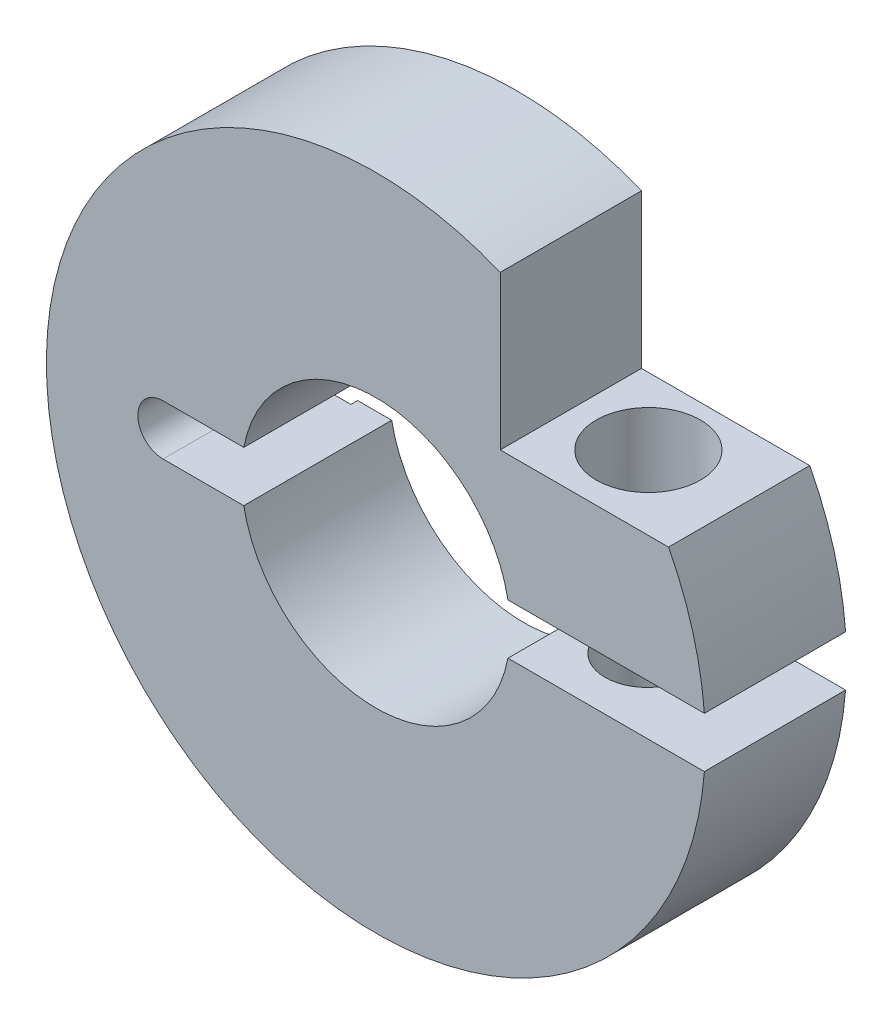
from build123d import *

# Parameters (mm, degrees)
EXTRUSION1_DEPTH        = 2.2
EXTRUSION1_DEPTH_BACK   = 2.2
D_GAGEMENT_M31_D        = 3.1
D_GAGEMENT_M31_DEPTH    = 3.75
TROU_TARAUD_M3X0_51_D   = 2.5
ESQUISSE5_R             = 9.8
ESQUISSE5_R_2           = 5
ENL_V_MAT_EXTRU_1_DEPTH = 0.2


with BuildPart() as part:
    # Esquisse1 → Extrusion1 (new, two sides: drawn at the far end of the back side and taken through both)
    with BuildSketch(Plane.XY.offset(-EXTRUSION1_DEPTH_BACK)):
        with BuildLine():
            Line((3.7, 9.074690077), (3.7, 4.5))
            Line((3.7, 4.5), (8.705745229, 4.5))
            ThreePointArc((8.705745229, 4.5), (9.426852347, 2.678517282), (9.771258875, 0.75))
            Line((9.771258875, 0.75), (3.929058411, 0.75))
            ThreePointArc((3.929058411, 0.75), (0, 4), (-3.929058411, 0.75))
            Line((-3.929058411, 0.75), (-6.329058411, 0.75))
            ThreePointArc((-6.329058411, 0.75), (-7.079058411, 0), (-6.329058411, -0.75))
            Line((-6.329058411, -0.75), (-3.929058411, -0.75))
            ThreePointArc((-3.929058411, -0.75), (0, -4), (3.929058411, -0.75))
            Line((3.929058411, -0.75), (9.771258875, -0.75))
            ThreePointArc((9.771258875, -0.75), (-8.336656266, -5.151714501), (3.7, 9.074690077))
        make_face()
    extrude(amount=EXTRUSION1_DEPTH + EXTRUSION1_DEPTH_BACK)

    # D_gagement M31
    with Locations(Plane(origin=(5.905745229, 4.5, 0), x_dir=(1, 0, 0), z_dir=(0, 1, 0))):
        with Locations((0, 0)):
            Hole(D_GAGEMENT_M31_D / 2, depth=D_GAGEMENT_M31_DEPTH)

    # Trou taraud_ M3x0.51 (through all)
    with Locations(Plane(origin=(5.871258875, -0.75, 0), x_dir=(1, 0, 0), z_dir=(0, 1, 0))):
        with Locations((0, 0)):
            Hole(TROU_TARAUD_M3X0_51_D / 2)

    # Esquisse5 → Enl_v. mat.-Extru.1 (cut)
    with BuildSketch(Plane(origin=(0, 0, -2.2), x_dir=(-1, 0, 0), z_dir=(0, 0, -1))):
        Circle(ESQUISSE5_R)
        Circle(ESQUISSE5_R_2, mode=Mode.SUBTRACT)
    extrude(amount=-ENL_V_MAT_EXTRU_1_DEPTH, mode=Mode.SUBTRACT)


solid = part.part
